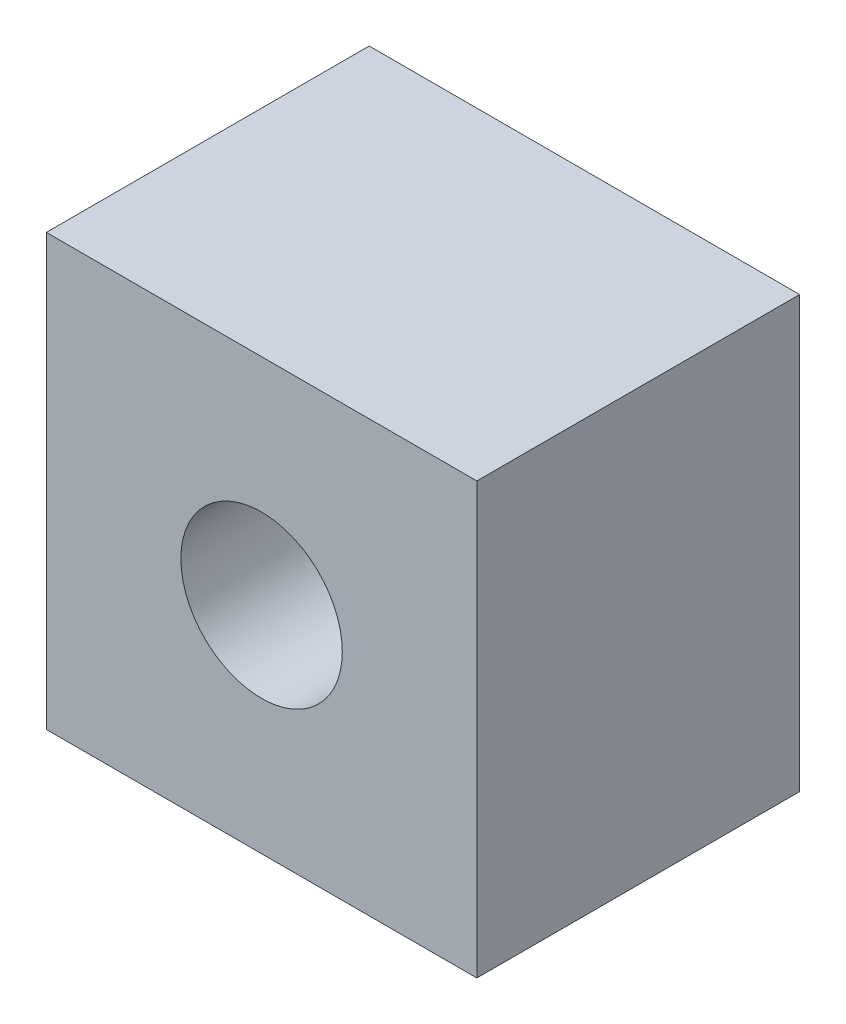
from build123d import *

# Parameters (mm, degrees)
ESQUISSE1_W      = 8
ESQUISSE1_H      = 8
ESQUISSE1_R      = 1.5
EXTRUSION1_DEPTH = 6


with BuildPart() as part:
    # Esquisse1 → Extrusion1 (new body)
    with BuildSketch(Plane.XY):
        Rectangle(ESQUISSE1_W, ESQUISSE1_H)
        Circle(ESQUISSE1_R, mode=Mode.SUBTRACT)
    extrude(amount=EXTRUSION1_DEPTH)


solid = part.part
